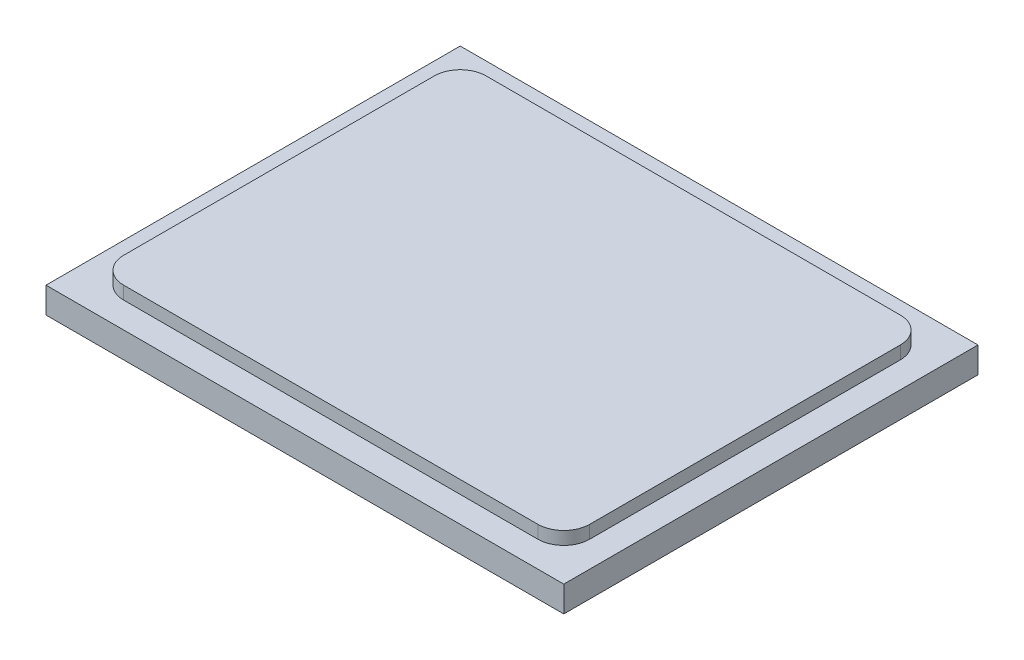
ISO-10303-21;
HEADER;
FILE_DESCRIPTION(('STEP AP214'),'2;1');
FILE_NAME('part.step','',(''),(''),'','','');
FILE_SCHEMA(('AUTOMOTIVE_DESIGN { 1 0 10303 214 1 1 1 1 }'));
ENDSEC;
DATA;
#1=APPLICATION_CONTEXT('core data for automotive mechanical design processes');
#2=APPLICATION_PROTOCOL_DEFINITION('international standard','automotive_design',2000,#1);
#3=PRODUCT_CONTEXT('',#1,'mechanical');
#4=PRODUCT('Part','Part','',(#3));
#5=PRODUCT_RELATED_PRODUCT_CATEGORY('part','',(#4));
#6=PRODUCT_DEFINITION_FORMATION('','',#4);
#7=PRODUCT_DEFINITION_CONTEXT('part definition',#1,'design');
#8=PRODUCT_DEFINITION('design','',#6,#7);
#9=PRODUCT_DEFINITION_SHAPE('','',#8);
#10=(LENGTH_UNIT() NAMED_UNIT(*) SI_UNIT(.MILLI.,.METRE.));
#11=(NAMED_UNIT(*) PLANE_ANGLE_UNIT() SI_UNIT($,.RADIAN.));
#12=(NAMED_UNIT(*) SI_UNIT($,.STERADIAN.) SOLID_ANGLE_UNIT());
#13=UNCERTAINTY_MEASURE_WITH_UNIT(LENGTH_MEASURE(1.E-05),#10,'distance_accuracy_value','');
#14=(GEOMETRIC_REPRESENTATION_CONTEXT(3) GLOBAL_UNCERTAINTY_ASSIGNED_CONTEXT((#13)) GLOBAL_UNIT_ASSIGNED_CONTEXT((#10,
#11,#12)) REPRESENTATION_CONTEXT('',''));
#15=CARTESIAN_POINT('',(0.,0.,0.));
#16=DIRECTION('',(0.,0.,1.));
#17=DIRECTION('',(1.,0.,0.));
#18=AXIS2_PLACEMENT_3D('',#15,#16,#17);
#19=CARTESIAN_POINT('',(-40.8708820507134,9.525,-22.513100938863));
#20=DIRECTION('',(1.,0.,0.));
#21=DIRECTION('',(0.,0.,-1.));
#22=AXIS2_PLACEMENT_3D('',#19,#20,#21);
#23=PLANE('',#22);
#24=DIRECTION('',(0.,0.,1.));
#25=VECTOR('',#24,1.);
#26=CARTESIAN_POINT('',(-40.8708820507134,6.35,-22.513100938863));
#27=LINE('',#26,#25);
#28=CARTESIAN_POINT('',(-40.8708820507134,6.35,-16.163100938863));
#29=VERTEX_POINT('',#28);
#30=CARTESIAN_POINT('',(-40.8708820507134,6.35,60.036899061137));
#31=VERTEX_POINT('',#30);
#32=EDGE_CURVE('E151',#29,#31,#27,.T.);
#33=ORIENTED_EDGE('',*,*,#32,.T.);
#34=DIRECTION('',(0.,1.,0.));
#35=VECTOR('',#34,1.);
#36=CARTESIAN_POINT('',(-40.8708820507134,6.35,60.036899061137));
#37=LINE('',#36,#35);
#38=CARTESIAN_POINT('',(-40.8708820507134,9.525,60.036899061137));
#39=VERTEX_POINT('',#38);
#40=EDGE_CURVE('E389',#31,#39,#37,.T.);
#41=ORIENTED_EDGE('',*,*,#40,.T.);
#42=DIRECTION('',(0.,0.,1.));
#43=VECTOR('',#42,1.);
#44=CARTESIAN_POINT('',(-40.8708820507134,9.525,-22.513100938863));
#45=LINE('',#44,#43);
#46=CARTESIAN_POINT('',(-40.8708820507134,9.525,-16.163100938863));
#47=VERTEX_POINT('',#46);
#48=EDGE_CURVE('E148',#47,#39,#45,.T.);
#49=ORIENTED_EDGE('',*,*,#48,.F.);
#50=DIRECTION('',(0.,1.,0.));
#51=VECTOR('',#50,1.);
#52=CARTESIAN_POINT('',(-40.8708820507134,6.35,-16.163100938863));
#53=LINE('',#52,#51);
#54=EDGE_CURVE('E399',#29,#47,#53,.T.);
#55=ORIENTED_EDGE('',*,*,#54,.F.);
#56=EDGE_LOOP('',(#33,#41,#49,#55));
#57=FACE_BOUND('',#56,.T.);
#58=ADVANCED_FACE('F36',(#57),#23,.F.);
#59=CARTESIAN_POINT('',(-40.8708820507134,9.525,66.386899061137));
#60=DIRECTION('',(0.,0.,-1.));
#61=DIRECTION('',(-1.,0.,0.));
#62=AXIS2_PLACEMENT_3D('',#59,#60,#61);
#63=PLANE('',#62);
#64=DIRECTION('',(0.,1.,0.));
#65=VECTOR('',#64,1.);
#66=CARTESIAN_POINT('',(-34.5208820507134,6.35,66.386899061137));
#67=LINE('',#66,#65);
#68=CARTESIAN_POINT('',(-34.5208820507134,6.35,66.386899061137));
#69=VERTEX_POINT('',#68);
#70=CARTESIAN_POINT('',(-34.5208820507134,9.525,66.386899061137));
#71=VERTEX_POINT('',#70);
#72=EDGE_CURVE('E391',#69,#71,#67,.T.);
#73=ORIENTED_EDGE('',*,*,#72,.F.);
#74=DIRECTION('',(1.,0.,0.));
#75=VECTOR('',#74,1.);
#76=CARTESIAN_POINT('',(-40.8708820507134,6.35,66.386899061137));
#77=LINE('',#76,#75);
#78=CARTESIAN_POINT('',(67.0791179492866,6.35,66.386899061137));
#79=VERTEX_POINT('',#78);
#80=EDGE_CURVE('E146',#69,#79,#77,.T.);
#81=ORIENTED_EDGE('',*,*,#80,.T.);
#82=DIRECTION('',(0.,1.,0.));
#83=VECTOR('',#82,1.);
#84=CARTESIAN_POINT('',(67.0791179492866,6.35,66.386899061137));
#85=LINE('',#84,#83);
#86=CARTESIAN_POINT('',(67.0791179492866,9.525,66.386899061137));
#87=VERTEX_POINT('',#86);
#88=EDGE_CURVE('E379',#79,#87,#85,.T.);
#89=ORIENTED_EDGE('',*,*,#88,.T.);
#90=DIRECTION('',(1.,0.,0.));
#91=VECTOR('',#90,1.);
#92=CARTESIAN_POINT('',(-40.8708820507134,9.525,66.386899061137));
#93=LINE('',#92,#91);
#94=EDGE_CURVE('E374',#71,#87,#93,.T.);
#95=ORIENTED_EDGE('',*,*,#94,.F.);
#96=EDGE_LOOP('',(#73,#81,#89,#95));
#97=FACE_BOUND('',#96,.T.);
#98=ADVANCED_FACE('F207',(#97),#63,.F.);
#99=CARTESIAN_POINT('',(73.4291179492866,9.525,-22.513100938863));
#100=DIRECTION('',(-1.,0.,0.));
#101=DIRECTION('',(0.,0.,1.));
#102=AXIS2_PLACEMENT_3D('',#99,#100,#101);
#103=PLANE('',#102);
#104=DIRECTION('',(0.,0.,-1.));
#105=VECTOR('',#104,1.);
#106=CARTESIAN_POINT('',(73.4291179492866,6.35,-22.513100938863));
#107=LINE('',#106,#105);
#108=CARTESIAN_POINT('',(73.4291179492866,6.35,60.036899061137));
#109=VERTEX_POINT('',#108);
#110=CARTESIAN_POINT('',(73.4291179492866,6.35,-16.163100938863));
#111=VERTEX_POINT('',#110);
#112=EDGE_CURVE('E140',#109,#111,#107,.T.);
#113=ORIENTED_EDGE('',*,*,#112,.T.);
#114=DIRECTION('',(0.,1.,0.));
#115=VECTOR('',#114,1.);
#116=CARTESIAN_POINT('',(73.4291179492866,6.35,-16.163100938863));
#117=LINE('',#116,#115);
#118=CARTESIAN_POINT('',(73.4291179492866,9.525,-16.163100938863));
#119=VERTEX_POINT('',#118);
#120=EDGE_CURVE('E123',#111,#119,#117,.T.);
#121=ORIENTED_EDGE('',*,*,#120,.T.);
#122=DIRECTION('',(0.,0.,-1.));
#123=VECTOR('',#122,1.);
#124=CARTESIAN_POINT('',(73.4291179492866,9.525,-22.513100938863));
#125=LINE('',#124,#123);
#126=CARTESIAN_POINT('',(73.4291179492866,9.525,60.036899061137));
#127=VERTEX_POINT('',#126);
#128=EDGE_CURVE('E376',#127,#119,#125,.T.);
#129=ORIENTED_EDGE('',*,*,#128,.F.);
#130=DIRECTION('',(0.,1.,0.));
#131=VECTOR('',#130,1.);
#132=CARTESIAN_POINT('',(73.4291179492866,6.35,60.036899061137));
#133=LINE('',#132,#131);
#134=EDGE_CURVE('E59',#109,#127,#133,.T.);
#135=ORIENTED_EDGE('',*,*,#134,.F.);
#136=EDGE_LOOP('',(#113,#121,#129,#135));
#137=FACE_BOUND('',#136,.T.);
#138=ADVANCED_FACE('F145',(#137),#103,.F.);
#139=CARTESIAN_POINT('',(-40.8708820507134,9.525,-22.513100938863));
#140=DIRECTION('',(0.,0.,1.));
#141=DIRECTION('',(1.,0.,0.));
#142=AXIS2_PLACEMENT_3D('',#139,#140,#141);
#143=PLANE('',#142);
#144=DIRECTION('',(-1.,0.,0.));
#145=VECTOR('',#144,1.);
#146=CARTESIAN_POINT('',(-40.8708820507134,6.35,-22.513100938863));
#147=LINE('',#146,#145);
#148=CARTESIAN_POINT('',(67.0791179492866,6.35,-22.513100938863));
#149=VERTEX_POINT('',#148);
#150=CARTESIAN_POINT('',(-34.5208820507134,6.35,-22.513100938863));
#151=VERTEX_POINT('',#150);
#152=EDGE_CURVE('E143',#149,#151,#147,.T.);
#153=ORIENTED_EDGE('',*,*,#152,.T.);
#154=DIRECTION('',(0.,1.,0.));
#155=VECTOR('',#154,1.);
#156=CARTESIAN_POINT('',(-34.5208820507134,6.35,-22.513100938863));
#157=LINE('',#156,#155);
#158=CARTESIAN_POINT('',(-34.5208820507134,9.525,-22.513100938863));
#159=VERTEX_POINT('',#158);
#160=EDGE_CURVE('E396',#151,#159,#157,.T.);
#161=ORIENTED_EDGE('',*,*,#160,.T.);
#162=DIRECTION('',(-1.,0.,0.));
#163=VECTOR('',#162,1.);
#164=CARTESIAN_POINT('',(-40.8708820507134,9.525,-22.513100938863));
#165=LINE('',#164,#163);
#166=CARTESIAN_POINT('',(67.0791179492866,9.525,-22.513100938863));
#167=VERTEX_POINT('',#166);
#168=EDGE_CURVE('E170',#167,#159,#165,.T.);
#169=ORIENTED_EDGE('',*,*,#168,.F.);
#170=DIRECTION('',(0.,1.,0.));
#171=VECTOR('',#170,1.);
#172=CARTESIAN_POINT('',(67.0791179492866,6.35,-22.513100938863));
#173=LINE('',#172,#171);
#174=EDGE_CURVE('E51',#149,#167,#173,.T.);
#175=ORIENTED_EDGE('',*,*,#174,.F.);
#176=EDGE_LOOP('',(#153,#161,#169,#175));
#177=FACE_BOUND('',#176,.T.);
#178=ADVANCED_FACE('F306',(#177),#143,.F.);
#179=CARTESIAN_POINT('',(0.,9.525,0.));
#180=DIRECTION('',(0.,1.,0.));
#181=DIRECTION('',(0.,0.,1.));
#182=AXIS2_PLACEMENT_3D('',#179,#180,#181);
#183=PLANE('',#182);
#184=ORIENTED_EDGE('',*,*,#48,.T.);
#185=CARTESIAN_POINT('',(-34.5208820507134,9.525,60.036899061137));
#186=DIRECTION('',(0.,1.,0.));
#187=DIRECTION('',(0.,0.,1.));
#188=AXIS2_PLACEMENT_3D('',#185,#186,#187);
#189=CIRCLE('',#188,6.35);
#190=EDGE_CURVE('E368',#39,#71,#189,.T.);
#191=ORIENTED_EDGE('',*,*,#190,.T.);
#192=ORIENTED_EDGE('',*,*,#94,.T.);
#193=CARTESIAN_POINT('',(67.0791179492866,9.525,60.036899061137));
#194=DIRECTION('',(0.,1.,0.));
#195=DIRECTION('',(0.,0.,1.));
#196=AXIS2_PLACEMENT_3D('',#193,#194,#195);
#197=CIRCLE('',#196,6.35);
#198=EDGE_CURVE('E386',#87,#127,#197,.T.);
#199=ORIENTED_EDGE('',*,*,#198,.T.);
#200=ORIENTED_EDGE('',*,*,#128,.T.);
#201=CARTESIAN_POINT('',(67.0791179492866,9.525,-16.163100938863));
#202=DIRECTION('',(0.,1.,0.));
#203=DIRECTION('',(0.,0.,1.));
#204=AXIS2_PLACEMENT_3D('',#201,#202,#203);
#205=CIRCLE('',#204,6.35);
#206=EDGE_CURVE('E127',#119,#167,#205,.T.);
#207=ORIENTED_EDGE('',*,*,#206,.T.);
#208=ORIENTED_EDGE('',*,*,#168,.T.);
#209=CARTESIAN_POINT('',(-34.5208820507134,9.525,-16.163100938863));
#210=DIRECTION('',(0.,1.,0.));
#211=DIRECTION('',(0.,0.,1.));
#212=AXIS2_PLACEMENT_3D('',#209,#210,#211);
#213=CIRCLE('',#212,6.35);
#214=EDGE_CURVE('E371',#159,#47,#213,.T.);
#215=ORIENTED_EDGE('',*,*,#214,.T.);
#216=EDGE_LOOP('',(#184,#191,#192,#199,#200,#207,#208,#215));
#217=FACE_BOUND('',#216,.T.);
#218=ADVANCED_FACE('F205',(#217),#183,.T.);
#219=CARTESIAN_POINT('',(-47.2208820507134,6.35,-28.863100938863));
#220=DIRECTION('',(1.,0.,0.));
#221=DIRECTION('',(0.,0.,-1.));
#222=AXIS2_PLACEMENT_3D('',#219,#220,#221);
#223=PLANE('',#222);
#224=DIRECTION('',(0.,0.,1.));
#225=VECTOR('',#224,1.);
#226=CARTESIAN_POINT('',(-47.2208820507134,0.,-28.863100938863));
#227=LINE('',#226,#225);
#228=CARTESIAN_POINT('',(-47.2208820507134,0.,-28.863100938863));
#229=VERTEX_POINT('',#228);
#230=CARTESIAN_POINT('',(-47.2208820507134,0.,72.736899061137));
#231=VERTEX_POINT('',#230);
#232=EDGE_CURVE('E166',#229,#231,#227,.T.);
#233=ORIENTED_EDGE('',*,*,#232,.T.);
#234=DIRECTION('',(0.,-1.,0.));
#235=VECTOR('',#234,1.);
#236=CARTESIAN_POINT('',(-47.2208820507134,6.35,72.736899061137));
#237=LINE('',#236,#235);
#238=CARTESIAN_POINT('',(-47.2208820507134,6.35,72.736899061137));
#239=VERTEX_POINT('',#238);
#240=EDGE_CURVE('E11',#239,#231,#237,.T.);
#241=ORIENTED_EDGE('',*,*,#240,.F.);
#242=DIRECTION('',(0.,0.,1.));
#243=VECTOR('',#242,1.);
#244=CARTESIAN_POINT('',(-47.2208820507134,6.35,-28.863100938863));
#245=LINE('',#244,#243);
#246=CARTESIAN_POINT('',(-47.2208820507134,6.35,-28.863100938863));
#247=VERTEX_POINT('',#246);
#248=EDGE_CURVE('E155',#247,#239,#245,.T.);
#249=ORIENTED_EDGE('',*,*,#248,.F.);
#250=DIRECTION('',(0.,-1.,0.));
#251=VECTOR('',#250,1.);
#252=CARTESIAN_POINT('',(-47.2208820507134,6.35,-28.863100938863));
#253=LINE('',#252,#251);
#254=EDGE_CURVE('E165',#247,#229,#253,.T.);
#255=ORIENTED_EDGE('',*,*,#254,.T.);
#256=EDGE_LOOP('',(#233,#241,#249,#255));
#257=FACE_BOUND('',#256,.T.);
#258=ADVANCED_FACE('F38',(#257),#223,.F.);
#259=CARTESIAN_POINT('',(-47.2208820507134,6.35,72.736899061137));
#260=DIRECTION('',(0.,0.,-1.));
#261=DIRECTION('',(-1.,0.,0.));
#262=AXIS2_PLACEMENT_3D('',#259,#260,#261);
#263=PLANE('',#262);
#264=DIRECTION('',(1.,0.,0.));
#265=VECTOR('',#264,1.);
#266=CARTESIAN_POINT('',(-47.2208820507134,0.,72.736899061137));
#267=LINE('',#266,#265);
#268=CARTESIAN_POINT('',(79.7791179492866,0.,72.736899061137));
#269=VERTEX_POINT('',#268);
#270=EDGE_CURVE('E169',#231,#269,#267,.T.);
#271=ORIENTED_EDGE('',*,*,#270,.T.);
#272=DIRECTION('',(0.,-1.,0.));
#273=VECTOR('',#272,1.);
#274=CARTESIAN_POINT('',(79.7791179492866,6.35,72.736899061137));
#275=LINE('',#274,#273);
#276=CARTESIAN_POINT('',(79.7791179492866,6.35,72.736899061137));
#277=VERTEX_POINT('',#276);
#278=EDGE_CURVE('E44',#277,#269,#275,.T.);
#279=ORIENTED_EDGE('',*,*,#278,.F.);
#280=DIRECTION('',(1.,0.,0.));
#281=VECTOR('',#280,1.);
#282=CARTESIAN_POINT('',(-47.2208820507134,6.35,72.736899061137));
#283=LINE('',#282,#281);
#284=EDGE_CURVE('E158',#239,#277,#283,.T.);
#285=ORIENTED_EDGE('',*,*,#284,.F.);
#286=ORIENTED_EDGE('',*,*,#240,.T.);
#287=EDGE_LOOP('',(#271,#279,#285,#286));
#288=FACE_BOUND('',#287,.T.);
#289=ADVANCED_FACE('F198',(#288),#263,.F.);
#290=CARTESIAN_POINT('',(79.7791179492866,6.35,-28.863100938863));
#291=DIRECTION('',(-1.,0.,0.));
#292=DIRECTION('',(0.,0.,1.));
#293=AXIS2_PLACEMENT_3D('',#290,#291,#292);
#294=PLANE('',#293);
#295=DIRECTION('',(0.,0.,-1.));
#296=VECTOR('',#295,1.);
#297=CARTESIAN_POINT('',(79.7791179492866,0.,-28.863100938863));
#298=LINE('',#297,#296);
#299=CARTESIAN_POINT('',(79.7791179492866,0.,-28.863100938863));
#300=VERTEX_POINT('',#299);
#301=EDGE_CURVE('E172',#269,#300,#298,.T.);
#302=ORIENTED_EDGE('',*,*,#301,.T.);
#303=DIRECTION('',(0.,-1.,0.));
#304=VECTOR('',#303,1.);
#305=CARTESIAN_POINT('',(79.7791179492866,6.35,-28.863100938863));
#306=LINE('',#305,#304);
#307=CARTESIAN_POINT('',(79.7791179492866,6.35,-28.863100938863));
#308=VERTEX_POINT('',#307);
#309=EDGE_CURVE('E177',#308,#300,#306,.T.);
#310=ORIENTED_EDGE('',*,*,#309,.F.);
#311=DIRECTION('',(0.,0.,-1.));
#312=VECTOR('',#311,1.);
#313=CARTESIAN_POINT('',(79.7791179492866,6.35,-28.863100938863));
#314=LINE('',#313,#312);
#315=EDGE_CURVE('E161',#277,#308,#314,.T.);
#316=ORIENTED_EDGE('',*,*,#315,.F.);
#317=ORIENTED_EDGE('',*,*,#278,.T.);
#318=EDGE_LOOP('',(#302,#310,#316,#317));
#319=FACE_BOUND('',#318,.T.);
#320=ADVANCED_FACE('F184',(#319),#294,.F.);
#321=CARTESIAN_POINT('',(-47.2208820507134,6.35,-28.863100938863));
#322=DIRECTION('',(0.,0.,1.));
#323=DIRECTION('',(1.,0.,0.));
#324=AXIS2_PLACEMENT_3D('',#321,#322,#323);
#325=PLANE('',#324);
#326=DIRECTION('',(-1.,0.,0.));
#327=VECTOR('',#326,1.);
#328=CARTESIAN_POINT('',(-47.2208820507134,0.,-28.863100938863));
#329=LINE('',#328,#327);
#330=EDGE_CURVE('E159',#300,#229,#329,.T.);
#331=ORIENTED_EDGE('',*,*,#330,.T.);
#332=ORIENTED_EDGE('',*,*,#254,.F.);
#333=DIRECTION('',(-1.,0.,0.));
#334=VECTOR('',#333,1.);
#335=CARTESIAN_POINT('',(-47.2208820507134,6.35,-28.863100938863));
#336=LINE('',#335,#334);
#337=EDGE_CURVE('E163',#308,#247,#336,.T.);
#338=ORIENTED_EDGE('',*,*,#337,.F.);
#339=ORIENTED_EDGE('',*,*,#309,.T.);
#340=EDGE_LOOP('',(#331,#332,#338,#339));
#341=FACE_BOUND('',#340,.T.);
#342=ADVANCED_FACE('F193',(#341),#325,.F.);
#343=CARTESIAN_POINT('',(0.,6.35,0.));
#344=DIRECTION('',(0.,1.,0.));
#345=DIRECTION('',(0.,0.,1.));
#346=AXIS2_PLACEMENT_3D('',#343,#344,#345);
#347=PLANE('',#346);
#348=ORIENTED_EDGE('',*,*,#32,.F.);
#349=CARTESIAN_POINT('',(-34.5208820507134,6.35,-16.163100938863));
#350=DIRECTION('',(0.,1.,0.));
#351=DIRECTION('',(0.,0.,1.));
#352=AXIS2_PLACEMENT_3D('',#349,#350,#351);
#353=CIRCLE('',#352,6.35);
#354=EDGE_CURVE('E400',#151,#29,#353,.T.);
#355=ORIENTED_EDGE('',*,*,#354,.F.);
#356=ORIENTED_EDGE('',*,*,#152,.F.);
#357=CARTESIAN_POINT('',(67.0791179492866,6.35,-16.163100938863));
#358=DIRECTION('',(0.,1.,0.));
#359=DIRECTION('',(0.,0.,1.));
#360=AXIS2_PLACEMENT_3D('',#357,#358,#359);
#361=CIRCLE('',#360,6.35);
#362=EDGE_CURVE('E126',#111,#149,#361,.T.);
#363=ORIENTED_EDGE('',*,*,#362,.F.);
#364=ORIENTED_EDGE('',*,*,#112,.F.);
#365=CARTESIAN_POINT('',(67.0791179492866,6.35,60.036899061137));
#366=DIRECTION('',(0.,1.,0.));
#367=DIRECTION('',(0.,0.,1.));
#368=AXIS2_PLACEMENT_3D('',#365,#366,#367);
#369=CIRCLE('',#368,6.35);
#370=EDGE_CURVE('E384',#79,#109,#369,.T.);
#371=ORIENTED_EDGE('',*,*,#370,.F.);
#372=ORIENTED_EDGE('',*,*,#80,.F.);
#373=CARTESIAN_POINT('',(-34.5208820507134,6.35,60.036899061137));
#374=DIRECTION('',(0.,1.,0.));
#375=DIRECTION('',(0.,0.,1.));
#376=AXIS2_PLACEMENT_3D('',#373,#374,#375);
#377=CIRCLE('',#376,6.35);
#378=EDGE_CURVE('E392',#31,#69,#377,.T.);
#379=ORIENTED_EDGE('',*,*,#378,.F.);
#380=EDGE_LOOP('',(#348,#355,#356,#363,#364,#371,#372,#379));
#381=FACE_BOUND('',#380,.T.);
#382=ORIENTED_EDGE('',*,*,#248,.T.);
#383=ORIENTED_EDGE('',*,*,#284,.T.);
#384=ORIENTED_EDGE('',*,*,#315,.T.);
#385=ORIENTED_EDGE('',*,*,#337,.T.);
#386=EDGE_LOOP('',(#382,#383,#384,#385));
#387=FACE_BOUND('',#386,.T.);
#388=ADVANCED_FACE('F137',(#381,#387),#347,.T.);
#389=CARTESIAN_POINT('',(0.,0.,0.));
#390=DIRECTION('',(0.,1.,0.));
#391=DIRECTION('',(0.,0.,1.));
#392=AXIS2_PLACEMENT_3D('',#389,#390,#391);
#393=PLANE('',#392);
#394=ORIENTED_EDGE('',*,*,#232,.F.);
#395=ORIENTED_EDGE('',*,*,#330,.F.);
#396=ORIENTED_EDGE('',*,*,#301,.F.);
#397=ORIENTED_EDGE('',*,*,#270,.F.);
#398=EDGE_LOOP('',(#394,#395,#396,#397));
#399=FACE_BOUND('',#398,.T.);
#400=ADVANCED_FACE('F190',(#399),#393,.F.);
#401=CARTESIAN_POINT('',(67.0791179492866,6.35,60.036899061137));
#402=DIRECTION('',(0.,1.,0.));
#403=DIRECTION('',(0.,0.,1.));
#404=AXIS2_PLACEMENT_3D('',#401,#402,#403);
#405=CYLINDRICAL_SURFACE('',#404,6.35);
#406=ORIENTED_EDGE('',*,*,#198,.F.);
#407=ORIENTED_EDGE('',*,*,#88,.F.);
#408=ORIENTED_EDGE('',*,*,#370,.T.);
#409=ORIENTED_EDGE('',*,*,#134,.T.);
#410=EDGE_LOOP('',(#406,#407,#408,#409));
#411=FACE_BOUND('',#410,.T.);
#412=ADVANCED_FACE('F222',(#411),#405,.T.);
#413=CARTESIAN_POINT('',(67.0791179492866,6.35,-16.163100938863));
#414=DIRECTION('',(0.,1.,0.));
#415=DIRECTION('',(0.,0.,1.));
#416=AXIS2_PLACEMENT_3D('',#413,#414,#415);
#417=CYLINDRICAL_SURFACE('',#416,6.35);
#418=ORIENTED_EDGE('',*,*,#206,.F.);
#419=ORIENTED_EDGE('',*,*,#120,.F.);
#420=ORIENTED_EDGE('',*,*,#362,.T.);
#421=ORIENTED_EDGE('',*,*,#174,.T.);
#422=EDGE_LOOP('',(#418,#419,#420,#421));
#423=FACE_BOUND('',#422,.T.);
#424=ADVANCED_FACE('F125',(#423),#417,.T.);
#425=CARTESIAN_POINT('',(-34.5208820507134,6.35,-16.163100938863));
#426=DIRECTION('',(0.,1.,0.));
#427=DIRECTION('',(0.,0.,1.));
#428=AXIS2_PLACEMENT_3D('',#425,#426,#427);
#429=CYLINDRICAL_SURFACE('',#428,6.35);
#430=ORIENTED_EDGE('',*,*,#214,.F.);
#431=ORIENTED_EDGE('',*,*,#160,.F.);
#432=ORIENTED_EDGE('',*,*,#354,.T.);
#433=ORIENTED_EDGE('',*,*,#54,.T.);
#434=EDGE_LOOP('',(#430,#431,#432,#433));
#435=FACE_BOUND('',#434,.T.);
#436=ADVANCED_FACE('F249',(#435),#429,.T.);
#437=CARTESIAN_POINT('',(-34.5208820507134,6.35,60.036899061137));
#438=DIRECTION('',(0.,1.,0.));
#439=DIRECTION('',(0.,0.,1.));
#440=AXIS2_PLACEMENT_3D('',#437,#438,#439);
#441=CYLINDRICAL_SURFACE('',#440,6.35);
#442=ORIENTED_EDGE('',*,*,#190,.F.);
#443=ORIENTED_EDGE('',*,*,#40,.F.);
#444=ORIENTED_EDGE('',*,*,#378,.T.);
#445=ORIENTED_EDGE('',*,*,#72,.T.);
#446=EDGE_LOOP('',(#442,#443,#444,#445));
#447=FACE_BOUND('',#446,.T.);
#448=ADVANCED_FACE('F256',(#447),#441,.T.);
#449=CLOSED_SHELL('',(#58,#98,#138,#178,#218,#258,#289,#320,#342,#388,#400,#412,#424,#436,#448));
#450=MANIFOLD_SOLID_BREP('B2',#449);
#451=ADVANCED_BREP_SHAPE_REPRESENTATION('',(#18,#450),#14);
#452=SHAPE_DEFINITION_REPRESENTATION(#9,#451);
ENDSEC;
END-ISO-10303-21;
